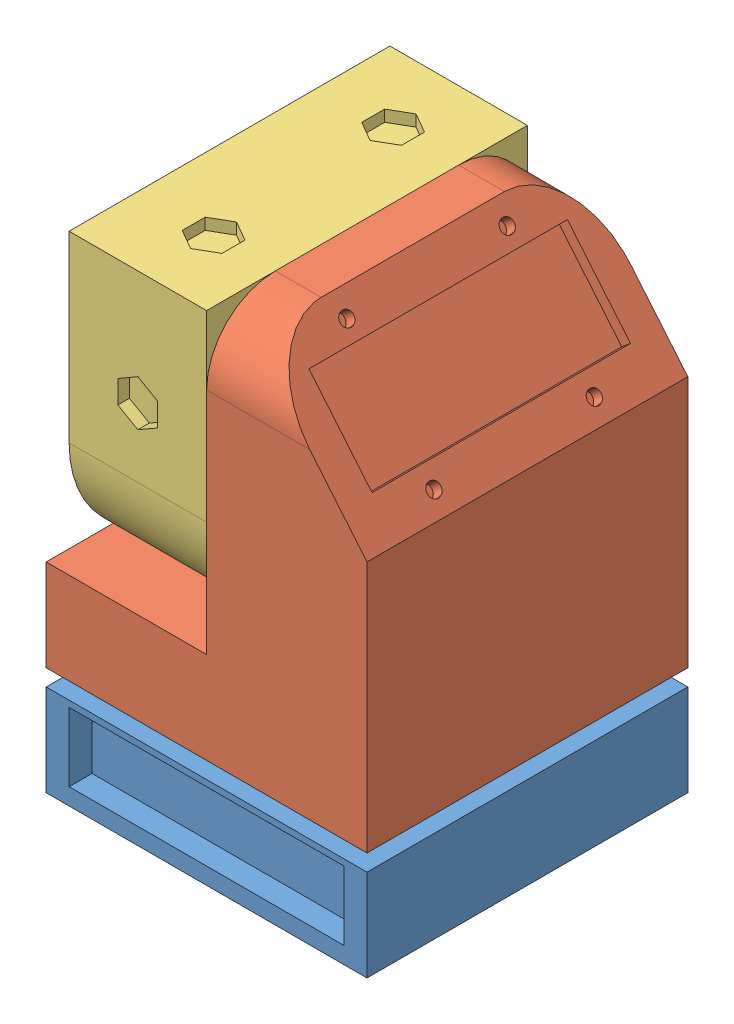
SolidWorks assembly camera bot.SLDASM, configuration Default (file format 4700). Lengths in mm.
Overall size (88.9 137.95 88.9).
3 component instances, 3 part files, 8 mates.
Components (placement in the parent):
- base-1: base.SLDPRT [Default] at origin size (88.9 25.4 88.9)
- body-1: body.SLDPRT [Default] at (0 29.9985 0) size (88.9 107.95 88.9)
- arm-1: arm.SLDPRT [Default] at (44.45 55.3985 -88.9) x (0 0 1) z (0 -1 0) size (88.9 38.1 82.55)
Mates (geometry in assembly coordinates):
- Coincident1: coincident aligned: plane of base-1 through (0 25.4 0) normal (0 0 1); plane of assembly through (0 0 0) normal (0 0 1)
- Coincident2: coincident anti-aligned: plane of base-1 through (0 25.4 0) normal (-1 0 0); plane of assembly through (0 0 0) normal (1 0 0)
- Coincident3: coincident anti-aligned: plane of base-1 through (0 0 -88.9) normal (0 -1 0); plane of assembly through (0 0 0) normal (0 1 0)
- Coincident4: coincident aligned: plane of base-1 through (0 25.4 0) normal (0 0 1); plane of body-1 through (0 55.3985 0) normal (0 0 1)
- Coincident5: coincident aligned: plane of base-1 through (88.9 25.4 0) normal (1 0 0); plane of body-1 through (88.9 55.3985 0) normal (1 0 0)
- Coincident6: coincident aligned: plane of body-1 through (57.15 137.9485 -182.6566) normal (0 1 0); plane of arm-1 through (6.35 137.9485 -88.9) normal (0 1 0)
- Coincident7: coincident anti-aligned: plane of body-1 through (44.45 137.9485 -182.6566) normal (-1 0 0); plane of arm-1 through (44.45 74.4485 -69.85) normal (1 0 0)
- Coincident8: coincident aligned: plane of body-1 through (0 55.3985 0) normal (0 0 1); plane of arm-1 through (6.35 87.1485 0) normal (0 0 1)
